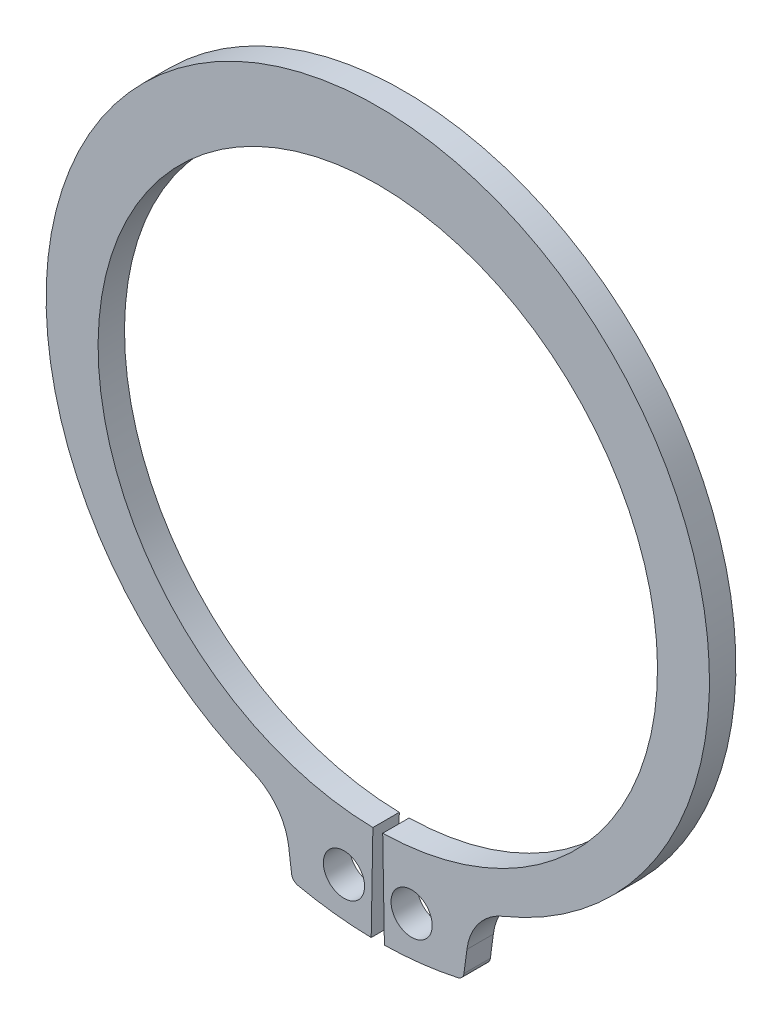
from build123d import *

# Parameters (mm, degrees)
BODYSKE_R  = 0.9906
BODY_DEPTH = 1.27


with BuildPart() as part:
    # BodySke → Body (new body)
    with BuildSketch(Plane.XY):
        with BuildLine():
            Line((0.236284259, -13.447224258), (0.3175, -18.069310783))
            ThreePointArc((0.3175, -18.069310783), (2.092434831, -17.950557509), (3.847095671, -17.657877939))
            ThreePointArc((3.847095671, -17.657877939), (4.046422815, -17.543522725), (4.143730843, -17.335341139))
            Line((4.143730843, -17.335341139), (4.285372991, -16.259462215))
            ThreePointArc((4.285372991, -16.259462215), (4.848818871, -14.904789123), (6.01671569, -14.016742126))
            ThreePointArc((6.01671569, -14.016742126), (0, 16.7005), (-6.01671569, -14.016742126))
            ThreePointArc((-6.01671569, -14.016742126), (-4.848818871, -14.904789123), (-4.285372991, -16.259462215))
            Line((-4.285372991, -16.259462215), (-4.143730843, -17.335341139))
            ThreePointArc((-4.143730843, -17.335341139), (-4.046422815, -17.543522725), (-3.847095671, -17.657877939))
            ThreePointArc((-3.847095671, -17.657877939), (-2.092434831, -17.950557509), (-0.3175, -18.069310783))
            Line((-0.3175, -18.069310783), (-0.236284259, -13.447224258))
            ThreePointArc((-0.236284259, -13.447224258), (0, 13.4493), (0.236284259, -13.447224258))
        make_face()
        with Locations((1.6256, -16.097930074)):
            Circle(BODYSKE_R, mode=Mode.SUBTRACT)
        with Locations((-1.6256, -16.097930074)):
            Circle(BODYSKE_R, mode=Mode.SUBTRACT)
    extrude(amount=-BODY_DEPTH)


solid = part.part
